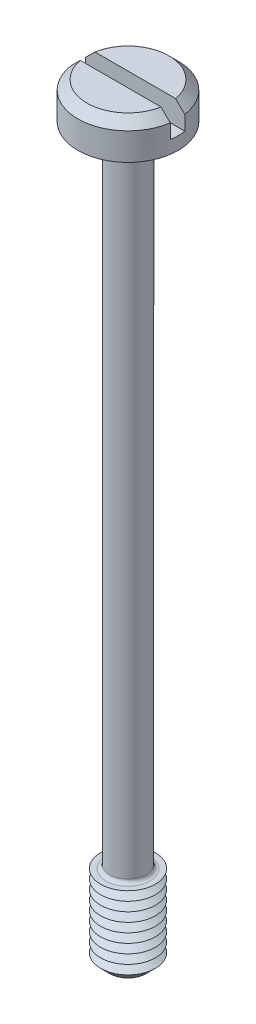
from build123d import *

# Parameters (mm, degrees)
SKETCH1_R           = 2.75
BOSS_EXTRUDE1_DEPTH = 2
SKETCH2_R           = 1
BOSS_EXTRUDE2_DEPTH = 40
SKETCH3_R           = 1.5
BOSS_EXTRUDE3_DEPTH = 4.5
CHAMFER1_SIZE       = 0.5
LPATTERN1_COUNT     = 8
LPATTERN1_PITCH     = 0.5
FILLET1_R           = 0.2
CHAMFER2_SIZE       = 0.5
SKETCH6_W           = 5.5
SKETCH6_H           = 0.8
CUT_EXTRUDE1_DEPTH  = 1.3


with BuildPart() as part:
    # Sketch1 → Boss-Extrude1 (new body)
    with BuildSketch(Plane(origin=(0, 0, 0), x_dir=(1, 0, 0), z_dir=(0, 1, 0))):
        with Locations(Location((0, 0, 0), (0, 0, 270))):
            Circle(SKETCH1_R)
    extrude(amount=BOSS_EXTRUDE1_DEPTH)

    # Sketch2 → Boss-Extrude2 (add)
    with BuildSketch(Plane.XZ):
        with Locations(Location((0, 0, 0), (0, 0, 270))):
            Circle(SKETCH2_R)
    extrude(amount=BOSS_EXTRUDE2_DEPTH)

    # Sketch3 → Boss-Extrude3 (add)
    with BuildSketch(Plane.XZ.offset(40)):
        with Locations(Location((0, 0, 0), (0, 0, 270))):
            Circle(SKETCH3_R)
    extrude(amount=-BOSS_EXTRUDE3_DEPTH)

    # Chamfer1
    chamfer1_edges = [part.edges().sort_by_distance(p)[0] for p in [
        (0, -40, 1.5),
    ]]
    chamfer(chamfer1_edges, length=CHAMFER1_SIZE)

    # Sketch5 → Cut-Revolve1 (revolve, cut)
    with BuildSketch(Plane(origin=(0, 0, 0), x_dir=(0, 0, -1), z_dir=(1, 0, 0))):
        Polygon((-1.5, -35.5), (-1.066987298, -35.75), (-1.5, -36), align=None)
    cut_revolve1 = revolve(axis=Axis((0, -6.58711856, 0), (0, -1, 0)), mode=Mode.SUBTRACT)

    # LPattern1: Cut-Revolve1 ×8
    with Locations(*[(0, -i * LPATTERN1_PITCH, 0) for i in range(1, LPATTERN1_COUNT)]):
        add(cut_revolve1, mode=Mode.SUBTRACT)

    # Fillet1
    fillet1_edges = [part.edges().sort_by_distance(p)[0] for p in [
        (0, 0, 1),
        (0, -35.5, 1),
    ]]
    fillet(fillet1_edges, radius=FILLET1_R)

    # Chamfer2
    chamfer2_edges = [part.edges().sort_by_distance(p)[0] for p in [
        (0, 2, -2.75),
    ]]
    chamfer(chamfer2_edges, length=CHAMFER2_SIZE)

    # Sketch6 → Cut-Extrude1 (cut)
    with BuildSketch(Plane(origin=(0, 2, 0), x_dir=(1, 0, 0), z_dir=(0, 1, 0))):
        Rectangle(SKETCH6_W, SKETCH6_H)
    extrude(amount=-CUT_EXTRUDE1_DEPTH, mode=Mode.SUBTRACT)


solid = part.part
